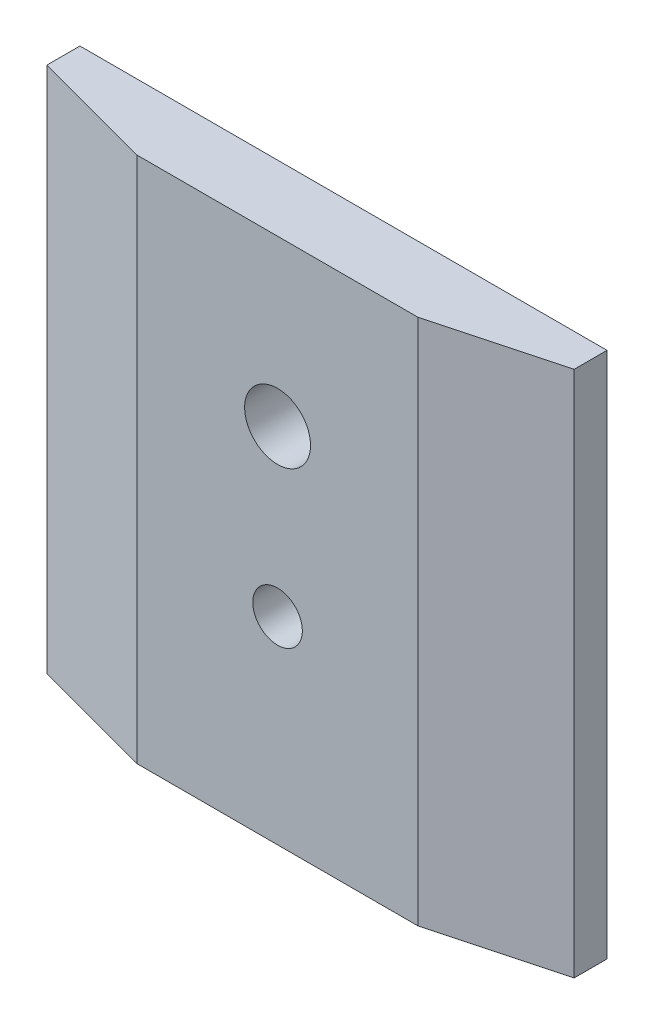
ISO-10303-21;
HEADER;
FILE_DESCRIPTION(('STEP AP214'),'2;1');
FILE_NAME('part.step','',(''),(''),'','','');
FILE_SCHEMA(('AUTOMOTIVE_DESIGN { 1 0 10303 214 1 1 1 1 }'));
ENDSEC;
DATA;
#1=APPLICATION_CONTEXT('core data for automotive mechanical design processes');
#2=APPLICATION_PROTOCOL_DEFINITION('international standard','automotive_design',2000,#1);
#3=PRODUCT_CONTEXT('',#1,'mechanical');
#4=PRODUCT('Part','Part','',(#3));
#5=PRODUCT_RELATED_PRODUCT_CATEGORY('part','',(#4));
#6=PRODUCT_DEFINITION_FORMATION('','',#4);
#7=PRODUCT_DEFINITION_CONTEXT('part definition',#1,'design');
#8=PRODUCT_DEFINITION('design','',#6,#7);
#9=PRODUCT_DEFINITION_SHAPE('','',#8);
#10=(LENGTH_UNIT() NAMED_UNIT(*) SI_UNIT(.MILLI.,.METRE.));
#11=(NAMED_UNIT(*) PLANE_ANGLE_UNIT() SI_UNIT($,.RADIAN.));
#12=(NAMED_UNIT(*) SI_UNIT($,.STERADIAN.) SOLID_ANGLE_UNIT());
#13=UNCERTAINTY_MEASURE_WITH_UNIT(LENGTH_MEASURE(1.E-05),#10,'distance_accuracy_value','');
#14=(GEOMETRIC_REPRESENTATION_CONTEXT(3) GLOBAL_UNCERTAINTY_ASSIGNED_CONTEXT((#13)) GLOBAL_UNIT_ASSIGNED_CONTEXT((#10,
#11,#12)) REPRESENTATION_CONTEXT('',''));
#15=CARTESIAN_POINT('',(0.,0.,0.));
#16=DIRECTION('',(0.,0.,1.));
#17=DIRECTION('',(1.,0.,0.));
#18=AXIS2_PLACEMENT_3D('',#15,#16,#17);
#19=CARTESIAN_POINT('',(0.,0.,6.35));
#20=DIRECTION('',(0.,0.,1.));
#21=DIRECTION('',(1.,0.,0.));
#22=AXIS2_PLACEMENT_3D('',#19,#20,#21);
#23=PLANE('',#22);
#24=CARTESIAN_POINT('',(0.,-6.35,6.35));
#25=DIRECTION('',(0.,0.,1.));
#26=DIRECTION('',(1.,0.,0.));
#27=AXIS2_PLACEMENT_3D('',#24,#25,#26);
#28=CIRCLE('',#27,2.3876);
#29=CARTESIAN_POINT('',(2.3876,-6.35,6.35));
#30=VERTEX_POINT('',#29);
#31=EDGE_CURVE('E104',#30,#30,#28,.T.);
#32=ORIENTED_EDGE('',*,*,#31,.F.);
#33=EDGE_LOOP('',(#32));
#34=FACE_BOUND('',#33,.T.);
#35=DIRECTION('',(-1.,0.,0.));
#36=VECTOR('',#35,1.);
#37=CARTESIAN_POINT('',(25.4,25.4,6.35));
#38=LINE('',#37,#36);
#39=CARTESIAN_POINT('',(13.5507386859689,25.4,6.35));
#40=VERTEX_POINT('',#39);
#41=CARTESIAN_POINT('',(-13.5507386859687,25.4,6.35000000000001));
#42=VERTEX_POINT('',#41);
#43=EDGE_CURVE('E110',#40,#42,#38,.T.);
#44=ORIENTED_EDGE('',*,*,#43,.T.);
#45=DIRECTION('',(0.,-1.,0.));
#46=VECTOR('',#45,1.);
#47=CARTESIAN_POINT('',(-13.5507386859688,-25.4,6.35));
#48=LINE('',#47,#46);
#49=CARTESIAN_POINT('',(-13.5507386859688,-25.4,6.35));
#50=VERTEX_POINT('',#49);
#51=EDGE_CURVE('E130',#42,#50,#48,.T.);
#52=ORIENTED_EDGE('',*,*,#51,.T.);
#53=DIRECTION('',(1.,0.,0.));
#54=VECTOR('',#53,1.);
#55=CARTESIAN_POINT('',(-25.4,-25.4,6.35));
#56=LINE('',#55,#54);
#57=CARTESIAN_POINT('',(13.5507386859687,-25.4,6.35000000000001));
#58=VERTEX_POINT('',#57);
#59=EDGE_CURVE('E116',#50,#58,#56,.T.);
#60=ORIENTED_EDGE('',*,*,#59,.T.);
#61=DIRECTION('',(0.,1.,0.));
#62=VECTOR('',#61,1.);
#63=CARTESIAN_POINT('',(13.5507386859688,25.4,6.35));
#64=LINE('',#63,#62);
#65=EDGE_CURVE('E89',#58,#40,#64,.T.);
#66=ORIENTED_EDGE('',*,*,#65,.T.);
#67=EDGE_LOOP('',(#44,#52,#60,#66));
#68=FACE_BOUND('',#67,.T.);
#69=CARTESIAN_POINT('',(0.,9.525,6.35));
#70=DIRECTION('',(0.,0.,1.));
#71=DIRECTION('',(1.,0.,0.));
#72=AXIS2_PLACEMENT_3D('',#69,#70,#71);
#73=CIRCLE('',#72,3.175);
#74=CARTESIAN_POINT('',(3.175,9.525,6.35));
#75=VERTEX_POINT('',#74);
#76=EDGE_CURVE('E144',#75,#75,#73,.T.);
#77=ORIENTED_EDGE('',*,*,#76,.F.);
#78=EDGE_LOOP('',(#77));
#79=FACE_BOUND('',#78,.T.);
#80=ADVANCED_FACE('F33',(#34,#68,#79),#23,.T.);
#81=CARTESIAN_POINT('',(0.,0.,0.));
#82=DIRECTION('',(0.,0.,1.));
#83=DIRECTION('',(1.,0.,0.));
#84=AXIS2_PLACEMENT_3D('',#81,#82,#83);
#85=PLANE('',#84);
#86=CARTESIAN_POINT('',(0.,-6.35,0.));
#87=DIRECTION('',(0.,0.,1.));
#88=DIRECTION('',(1.,0.,0.));
#89=AXIS2_PLACEMENT_3D('',#86,#87,#88);
#90=CIRCLE('',#89,2.3876);
#91=CARTESIAN_POINT('',(2.3876,-6.35,0.));
#92=VERTEX_POINT('',#91);
#93=EDGE_CURVE('E107',#92,#92,#90,.T.);
#94=ORIENTED_EDGE('',*,*,#93,.T.);
#95=EDGE_LOOP('',(#94));
#96=FACE_BOUND('',#95,.T.);
#97=DIRECTION('',(0.,-1.,0.));
#98=VECTOR('',#97,1.);
#99=CARTESIAN_POINT('',(-25.4,25.4,0.));
#100=LINE('',#99,#98);
#101=CARTESIAN_POINT('',(-25.4,25.4,0.));
#102=VERTEX_POINT('',#101);
#103=CARTESIAN_POINT('',(-25.4,-25.4,0.));
#104=VERTEX_POINT('',#103);
#105=EDGE_CURVE('E97',#102,#104,#100,.T.);
#106=ORIENTED_EDGE('',*,*,#105,.F.);
#107=DIRECTION('',(-1.,0.,0.));
#108=VECTOR('',#107,1.);
#109=CARTESIAN_POINT('',(25.4,25.4,0.));
#110=LINE('',#109,#108);
#111=CARTESIAN_POINT('',(25.4,25.4,0.));
#112=VERTEX_POINT('',#111);
#113=EDGE_CURVE('E114',#112,#102,#110,.T.);
#114=ORIENTED_EDGE('',*,*,#113,.F.);
#115=DIRECTION('',(0.,1.,0.));
#116=VECTOR('',#115,1.);
#117=CARTESIAN_POINT('',(25.4,-25.4,0.));
#118=LINE('',#117,#116);
#119=CARTESIAN_POINT('',(25.4,-25.4,0.));
#120=VERTEX_POINT('',#119);
#121=EDGE_CURVE('E99',#120,#112,#118,.T.);
#122=ORIENTED_EDGE('',*,*,#121,.F.);
#123=DIRECTION('',(1.,0.,0.));
#124=VECTOR('',#123,1.);
#125=CARTESIAN_POINT('',(-25.4,-25.4,0.));
#126=LINE('',#125,#124);
#127=EDGE_CURVE('E86',#104,#120,#126,.T.);
#128=ORIENTED_EDGE('',*,*,#127,.F.);
#129=EDGE_LOOP('',(#106,#114,#122,#128));
#130=FACE_BOUND('',#129,.T.);
#131=CARTESIAN_POINT('',(0.,9.525,0.));
#132=DIRECTION('',(0.,0.,1.));
#133=DIRECTION('',(1.,0.,0.));
#134=AXIS2_PLACEMENT_3D('',#131,#132,#133);
#135=CIRCLE('',#134,3.175);
#136=CARTESIAN_POINT('',(3.175,9.525,0.));
#137=VERTEX_POINT('',#136);
#138=EDGE_CURVE('E146',#137,#137,#135,.T.);
#139=ORIENTED_EDGE('',*,*,#138,.T.);
#140=EDGE_LOOP('',(#139));
#141=FACE_BOUND('',#140,.T.);
#142=ADVANCED_FACE('F94',(#96,#130,#141),#85,.F.);
#143=CARTESIAN_POINT('',(-25.4,25.4,6.35));
#144=DIRECTION('',(1.,0.,0.));
#145=DIRECTION('',(0.,1.,0.));
#146=AXIS2_PLACEMENT_3D('',#143,#144,#145);
#147=PLANE('',#146);
#148=DIRECTION('',(0.,0.,-1.));
#149=VECTOR('',#148,1.);
#150=CARTESIAN_POINT('',(-25.4,-25.4,6.35));
#151=LINE('',#150,#149);
#152=CARTESIAN_POINT('',(-25.4,-25.4,3.175));
#153=VERTEX_POINT('',#152);
#154=EDGE_CURVE('E82',#153,#104,#151,.T.);
#155=ORIENTED_EDGE('',*,*,#154,.F.);
#156=DIRECTION('',(0.,1.,0.));
#157=VECTOR('',#156,1.);
#158=CARTESIAN_POINT('',(-25.4,25.4,3.175));
#159=LINE('',#158,#157);
#160=CARTESIAN_POINT('',(-25.4,25.4,3.175));
#161=VERTEX_POINT('',#160);
#162=EDGE_CURVE('E41',#153,#161,#159,.T.);
#163=ORIENTED_EDGE('',*,*,#162,.T.);
#164=DIRECTION('',(0.,0.,-1.));
#165=VECTOR('',#164,1.);
#166=CARTESIAN_POINT('',(-25.4,25.4,6.35));
#167=LINE('',#166,#165);
#168=EDGE_CURVE('E102',#161,#102,#167,.T.);
#169=ORIENTED_EDGE('',*,*,#168,.T.);
#170=ORIENTED_EDGE('',*,*,#105,.T.);
#171=EDGE_LOOP('',(#155,#163,#169,#170));
#172=FACE_BOUND('',#171,.T.);
#173=ADVANCED_FACE('F101',(#172),#147,.F.);
#174=CARTESIAN_POINT('',(-25.4,-25.4,6.35));
#175=DIRECTION('',(0.,1.,0.));
#176=DIRECTION('',(0.,0.,1.));
#177=AXIS2_PLACEMENT_3D('',#174,#175,#176);
#178=PLANE('',#177);
#179=ORIENTED_EDGE('',*,*,#59,.F.);
#180=DIRECTION('',(-0.965925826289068,0.,-0.258819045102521));
#181=VECTOR('',#180,1.);
#182=CARTESIAN_POINT('',(-13.5507386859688,-25.4,6.35));
#183=LINE('',#182,#181);
#184=EDGE_CURVE('E55',#50,#153,#183,.T.);
#185=ORIENTED_EDGE('',*,*,#184,.T.);
#186=ORIENTED_EDGE('',*,*,#154,.T.);
#187=ORIENTED_EDGE('',*,*,#127,.T.);
#188=DIRECTION('',(0.,0.,-1.));
#189=VECTOR('',#188,1.);
#190=CARTESIAN_POINT('',(25.4,-25.4,6.35));
#191=LINE('',#190,#189);
#192=CARTESIAN_POINT('',(25.4,-25.4,3.175));
#193=VERTEX_POINT('',#192);
#194=EDGE_CURVE('E90',#193,#120,#191,.T.);
#195=ORIENTED_EDGE('',*,*,#194,.F.);
#196=DIRECTION('',(-0.965925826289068,0.,0.258819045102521));
#197=VECTOR('',#196,1.);
#198=CARTESIAN_POINT('',(13.5507386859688,-25.4,6.35));
#199=LINE('',#198,#197);
#200=EDGE_CURVE('E127',#193,#58,#199,.T.);
#201=ORIENTED_EDGE('',*,*,#200,.T.);
#202=EDGE_LOOP('',(#179,#185,#186,#187,#195,#201));
#203=FACE_BOUND('',#202,.T.);
#204=ADVANCED_FACE('F84',(#203),#178,.F.);
#205=CARTESIAN_POINT('',(25.4,-25.4,6.35));
#206=DIRECTION('',(-1.,0.,0.));
#207=DIRECTION('',(0.,-1.,0.));
#208=AXIS2_PLACEMENT_3D('',#205,#206,#207);
#209=PLANE('',#208);
#210=DIRECTION('',(0.,0.,-1.));
#211=VECTOR('',#210,1.);
#212=CARTESIAN_POINT('',(25.4,25.4,6.35));
#213=LINE('',#212,#211);
#214=CARTESIAN_POINT('',(25.4,25.4,3.175));
#215=VERTEX_POINT('',#214);
#216=EDGE_CURVE('E118',#215,#112,#213,.T.);
#217=ORIENTED_EDGE('',*,*,#216,.F.);
#218=DIRECTION('',(0.,-1.,0.));
#219=VECTOR('',#218,1.);
#220=CARTESIAN_POINT('',(25.4,-25.4,3.175));
#221=LINE('',#220,#219);
#222=EDGE_CURVE('E125',#215,#193,#221,.T.);
#223=ORIENTED_EDGE('',*,*,#222,.T.);
#224=ORIENTED_EDGE('',*,*,#194,.T.);
#225=ORIENTED_EDGE('',*,*,#121,.T.);
#226=EDGE_LOOP('',(#217,#223,#224,#225));
#227=FACE_BOUND('',#226,.T.);
#228=ADVANCED_FACE('F170',(#227),#209,.F.);
#229=CARTESIAN_POINT('',(25.4,25.4,6.35));
#230=DIRECTION('',(0.,-1.,0.));
#231=DIRECTION('',(0.,0.,-1.));
#232=AXIS2_PLACEMENT_3D('',#229,#230,#231);
#233=PLANE('',#232);
#234=ORIENTED_EDGE('',*,*,#168,.F.);
#235=DIRECTION('',(0.965925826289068,0.,0.258819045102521));
#236=VECTOR('',#235,1.);
#237=CARTESIAN_POINT('',(-13.5507386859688,25.4,6.35));
#238=LINE('',#237,#236);
#239=EDGE_CURVE('E11',#161,#42,#238,.T.);
#240=ORIENTED_EDGE('',*,*,#239,.T.);
#241=ORIENTED_EDGE('',*,*,#43,.F.);
#242=DIRECTION('',(0.965925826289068,0.,-0.258819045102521));
#243=VECTOR('',#242,1.);
#244=CARTESIAN_POINT('',(13.5507386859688,25.4,6.35));
#245=LINE('',#244,#243);
#246=EDGE_CURVE('E123',#40,#215,#245,.T.);
#247=ORIENTED_EDGE('',*,*,#246,.T.);
#248=ORIENTED_EDGE('',*,*,#216,.T.);
#249=ORIENTED_EDGE('',*,*,#113,.T.);
#250=EDGE_LOOP('',(#234,#240,#241,#247,#248,#249));
#251=FACE_BOUND('',#250,.T.);
#252=ADVANCED_FACE('F167',(#251),#233,.F.);
#253=CARTESIAN_POINT('',(0.,-6.35,6.35));
#254=DIRECTION('',(0.,0.,-1.));
#255=DIRECTION('',(-1.,0.,0.));
#256=AXIS2_PLACEMENT_3D('',#253,#254,#255);
#257=CYLINDRICAL_SURFACE('',#256,2.3876);
#258=ORIENTED_EDGE('',*,*,#31,.T.);
#259=EDGE_LOOP('',(#258));
#260=FACE_BOUND('',#259,.T.);
#261=ORIENTED_EDGE('',*,*,#93,.F.);
#262=EDGE_LOOP('',(#261));
#263=FACE_BOUND('',#262,.T.);
#264=ADVANCED_FACE('F164',(#260,#263),#257,.F.);
#265=CARTESIAN_POINT('',(0.,9.525,6.35));
#266=DIRECTION('',(0.,0.,-1.));
#267=DIRECTION('',(-1.,0.,0.));
#268=AXIS2_PLACEMENT_3D('',#265,#266,#267);
#269=CYLINDRICAL_SURFACE('',#268,3.175);
#270=ORIENTED_EDGE('',*,*,#76,.T.);
#271=EDGE_LOOP('',(#270));
#272=FACE_BOUND('',#271,.T.);
#273=ORIENTED_EDGE('',*,*,#138,.F.);
#274=EDGE_LOOP('',(#273));
#275=FACE_BOUND('',#274,.T.);
#276=ADVANCED_FACE('F152',(#272,#275),#269,.F.);
#277=CARTESIAN_POINT('',(13.5507386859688,0.,6.35));
#278=DIRECTION('',(0.258819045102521,0.,0.965925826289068));
#279=DIRECTION('',(0.,-1.,0.));
#280=AXIS2_PLACEMENT_3D('',#277,#278,#279);
#281=PLANE('',#280);
#282=ORIENTED_EDGE('',*,*,#200,.F.);
#283=ORIENTED_EDGE('',*,*,#222,.F.);
#284=ORIENTED_EDGE('',*,*,#246,.F.);
#285=ORIENTED_EDGE('',*,*,#65,.F.);
#286=EDGE_LOOP('',(#282,#283,#284,#285));
#287=FACE_BOUND('',#286,.T.);
#288=ADVANCED_FACE('F178',(#287),#281,.T.);
#289=CARTESIAN_POINT('',(-13.5507386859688,0.,6.35));
#290=DIRECTION('',(-0.258819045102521,0.,0.965925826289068));
#291=DIRECTION('',(0.,1.,0.));
#292=AXIS2_PLACEMENT_3D('',#289,#290,#291);
#293=PLANE('',#292);
#294=ORIENTED_EDGE('',*,*,#239,.F.);
#295=ORIENTED_EDGE('',*,*,#162,.F.);
#296=ORIENTED_EDGE('',*,*,#184,.F.);
#297=ORIENTED_EDGE('',*,*,#51,.F.);
#298=EDGE_LOOP('',(#294,#295,#296,#297));
#299=FACE_BOUND('',#298,.T.);
#300=ADVANCED_FACE('F35',(#299),#293,.T.);
#301=CLOSED_SHELL('',(#80,#142,#173,#204,#228,#252,#264,#276,#288,#300));
#302=MANIFOLD_SOLID_BREP('B2',#301);
#303=ADVANCED_BREP_SHAPE_REPRESENTATION('',(#18,#302),#14);
#304=SHAPE_DEFINITION_REPRESENTATION(#9,#303);
ENDSEC;
END-ISO-10303-21;
